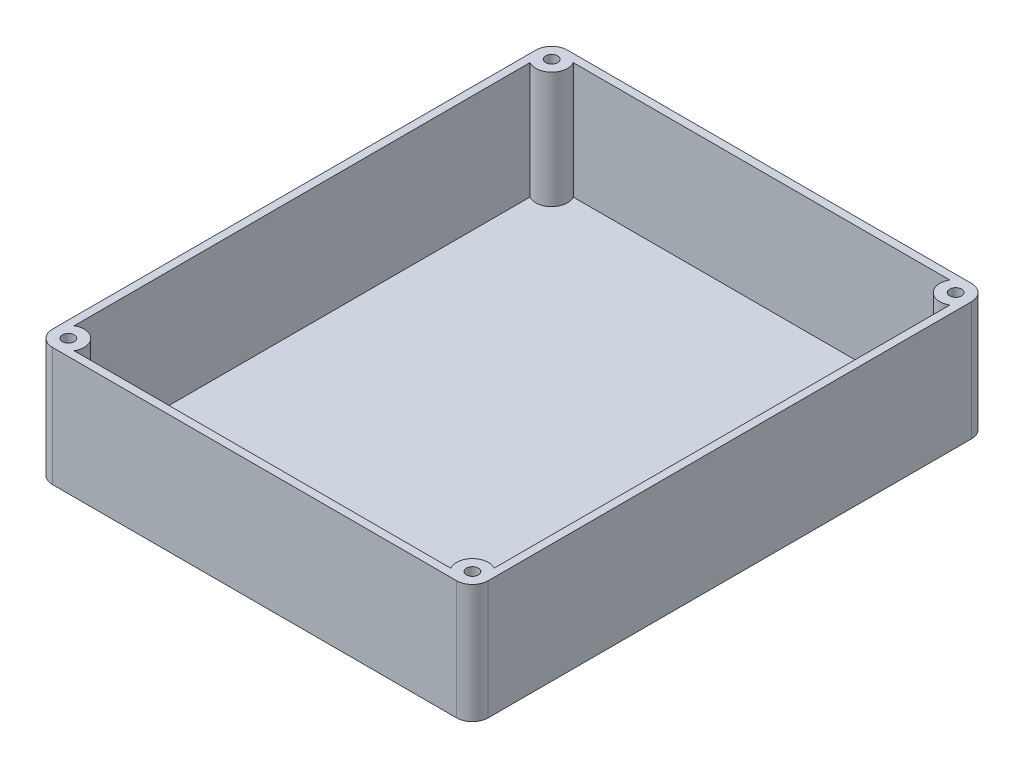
ISO-10303-21;
HEADER;
FILE_DESCRIPTION(('STEP AP214'),'2;1');
FILE_NAME('part.step','',(''),(''),'','','');
FILE_SCHEMA(('AUTOMOTIVE_DESIGN { 1 0 10303 214 1 1 1 1 }'));
ENDSEC;
DATA;
#1=APPLICATION_CONTEXT('core data for automotive mechanical design processes');
#2=APPLICATION_PROTOCOL_DEFINITION('international standard','automotive_design',2000,#1);
#3=PRODUCT_CONTEXT('',#1,'mechanical');
#4=PRODUCT('Part','Part','',(#3));
#5=PRODUCT_RELATED_PRODUCT_CATEGORY('part','',(#4));
#6=PRODUCT_DEFINITION_FORMATION('','',#4);
#7=PRODUCT_DEFINITION_CONTEXT('part definition',#1,'design');
#8=PRODUCT_DEFINITION('design','',#6,#7);
#9=PRODUCT_DEFINITION_SHAPE('','',#8);
#10=(LENGTH_UNIT() NAMED_UNIT(*) SI_UNIT(.MILLI.,.METRE.));
#11=(NAMED_UNIT(*) PLANE_ANGLE_UNIT() SI_UNIT($,.RADIAN.));
#12=(NAMED_UNIT(*) SI_UNIT($,.STERADIAN.) SOLID_ANGLE_UNIT());
#13=UNCERTAINTY_MEASURE_WITH_UNIT(LENGTH_MEASURE(1.E-05),#10,'distance_accuracy_value','');
#14=(GEOMETRIC_REPRESENTATION_CONTEXT(3) GLOBAL_UNCERTAINTY_ASSIGNED_CONTEXT((#13)) GLOBAL_UNIT_ASSIGNED_CONTEXT((#10,
#11,#12)) REPRESENTATION_CONTEXT('',''));
#15=CARTESIAN_POINT('',(0.,0.,0.));
#16=DIRECTION('',(0.,0.,1.));
#17=DIRECTION('',(1.,0.,0.));
#18=AXIS2_PLACEMENT_3D('',#15,#16,#17);
#19=CARTESIAN_POINT('',(53.,30.,-63.));
#20=DIRECTION('',(-1.,0.,0.));
#21=DIRECTION('',(0.,0.,1.));
#22=AXIS2_PLACEMENT_3D('',#19,#20,#21);
#23=PLANE('',#22);
#24=DIRECTION('',(0.,1.,0.));
#25=VECTOR('',#24,1.);
#26=CARTESIAN_POINT('',(53.,-10.7137084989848,57.5358983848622));
#27=LINE('',#26,#25);
#28=CARTESIAN_POINT('',(53.,30.,57.5358983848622));
#29=VERTEX_POINT('',#28);
#30=CARTESIAN_POINT('',(53.,0.6,57.5358983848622));
#31=VERTEX_POINT('',#30);
#32=EDGE_CURVE('E64',#29,#31,#27,.F.);
#33=ORIENTED_EDGE('',*,*,#32,.F.);
#34=DIRECTION('',(0.,0.,-1.));
#35=VECTOR('',#34,1.);
#36=CARTESIAN_POINT('',(53.,30.,-63.));
#37=LINE('',#36,#35);
#38=CARTESIAN_POINT('',(53.,30.,-57.5358983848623));
#39=VERTEX_POINT('',#38);
#40=EDGE_CURVE('E189',#29,#39,#37,.T.);
#41=ORIENTED_EDGE('',*,*,#40,.T.);
#42=DIRECTION('',(0.,1.,0.));
#43=VECTOR('',#42,1.);
#44=CARTESIAN_POINT('',(53.,-10.7137084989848,-57.5358983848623));
#45=LINE('',#44,#43);
#46=CARTESIAN_POINT('',(53.,0.6,-57.5358983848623));
#47=VERTEX_POINT('',#46);
#48=EDGE_CURVE('E401',#47,#39,#45,.T.);
#49=ORIENTED_EDGE('',*,*,#48,.F.);
#50=DIRECTION('',(0.,0.,1.));
#51=VECTOR('',#50,1.);
#52=CARTESIAN_POINT('',(53.,0.6,-63.));
#53=LINE('',#52,#51);
#54=EDGE_CURVE('E180',#47,#31,#53,.T.);
#55=ORIENTED_EDGE('',*,*,#54,.T.);
#56=EDGE_LOOP('',(#33,#41,#49,#55));
#57=FACE_BOUND('',#56,.T.);
#58=ADVANCED_FACE('F41',(#57),#23,.T.);
#59=CARTESIAN_POINT('',(53.,30.,-63.));
#60=DIRECTION('',(0.,0.,1.));
#61=DIRECTION('',(1.,0.,0.));
#62=AXIS2_PLACEMENT_3D('',#59,#60,#61);
#63=PLANE('',#62);
#64=DIRECTION('',(0.,1.,0.));
#65=VECTOR('',#64,1.);
#66=CARTESIAN_POINT('',(47.5358983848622,-10.7137084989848,-63.));
#67=LINE('',#66,#65);
#68=CARTESIAN_POINT('',(47.5358983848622,30.,-63.));
#69=VERTEX_POINT('',#68);
#70=CARTESIAN_POINT('',(47.5358983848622,0.6,-63.));
#71=VERTEX_POINT('',#70);
#72=EDGE_CURVE('E396',#69,#71,#67,.F.);
#73=ORIENTED_EDGE('',*,*,#72,.F.);
#74=DIRECTION('',(-1.,0.,0.));
#75=VECTOR('',#74,1.);
#76=CARTESIAN_POINT('',(53.,30.,-63.));
#77=LINE('',#76,#75);
#78=CARTESIAN_POINT('',(-47.5358983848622,30.,-63.));
#79=VERTEX_POINT('',#78);
#80=EDGE_CURVE('E191',#69,#79,#77,.T.);
#81=ORIENTED_EDGE('',*,*,#80,.T.);
#82=DIRECTION('',(0.,1.,0.));
#83=VECTOR('',#82,1.);
#84=CARTESIAN_POINT('',(-47.5358983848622,-10.7137084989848,-63.));
#85=LINE('',#84,#83);
#86=CARTESIAN_POINT('',(-47.5358983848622,0.6,-63.));
#87=VERTEX_POINT('',#86);
#88=EDGE_CURVE('E177',#87,#79,#85,.T.);
#89=ORIENTED_EDGE('',*,*,#88,.F.);
#90=DIRECTION('',(1.,0.,0.));
#91=VECTOR('',#90,1.);
#92=CARTESIAN_POINT('',(53.,0.6,-63.));
#93=LINE('',#92,#91);
#94=EDGE_CURVE('E176',#87,#71,#93,.T.);
#95=ORIENTED_EDGE('',*,*,#94,.T.);
#96=EDGE_LOOP('',(#73,#81,#89,#95));
#97=FACE_BOUND('',#96,.T.);
#98=ADVANCED_FACE('F287',(#97),#63,.T.);
#99=CARTESIAN_POINT('',(-53.,30.,-63.));
#100=DIRECTION('',(1.,0.,0.));
#101=DIRECTION('',(0.,0.,-1.));
#102=AXIS2_PLACEMENT_3D('',#99,#100,#101);
#103=PLANE('',#102);
#104=DIRECTION('',(0.,1.,0.));
#105=VECTOR('',#104,1.);
#106=CARTESIAN_POINT('',(-53.,-10.7137084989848,57.5358983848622));
#107=LINE('',#106,#105);
#108=CARTESIAN_POINT('',(-53.,0.6,57.5358983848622));
#109=VERTEX_POINT('',#108);
#110=CARTESIAN_POINT('',(-53.,30.,57.5358983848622));
#111=VERTEX_POINT('',#110);
#112=EDGE_CURVE('E154',#109,#111,#107,.T.);
#113=ORIENTED_EDGE('',*,*,#112,.F.);
#114=DIRECTION('',(0.,0.,-1.));
#115=VECTOR('',#114,1.);
#116=CARTESIAN_POINT('',(-53.,0.6,-63.));
#117=LINE('',#116,#115);
#118=CARTESIAN_POINT('',(-53.,0.6,-57.5358983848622));
#119=VERTEX_POINT('',#118);
#120=EDGE_CURVE('E166',#109,#119,#117,.T.);
#121=ORIENTED_EDGE('',*,*,#120,.T.);
#122=DIRECTION('',(0.,1.,0.));
#123=VECTOR('',#122,1.);
#124=CARTESIAN_POINT('',(-53.,-10.7137084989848,-57.5358983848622));
#125=LINE('',#124,#123);
#126=CARTESIAN_POINT('',(-53.,30.,-57.5358983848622));
#127=VERTEX_POINT('',#126);
#128=EDGE_CURVE('E183',#127,#119,#125,.F.);
#129=ORIENTED_EDGE('',*,*,#128,.F.);
#130=DIRECTION('',(0.,0.,1.));
#131=VECTOR('',#130,1.);
#132=CARTESIAN_POINT('',(-53.,30.,-63.));
#133=LINE('',#132,#131);
#134=EDGE_CURVE('E169',#127,#111,#133,.T.);
#135=ORIENTED_EDGE('',*,*,#134,.T.);
#136=EDGE_LOOP('',(#113,#121,#129,#135));
#137=FACE_BOUND('',#136,.T.);
#138=ADVANCED_FACE('F164',(#137),#103,.T.);
#139=CARTESIAN_POINT('',(53.,30.,63.));
#140=DIRECTION('',(0.,0.,-1.));
#141=DIRECTION('',(-1.,0.,0.));
#142=AXIS2_PLACEMENT_3D('',#139,#140,#141);
#143=PLANE('',#142);
#144=DIRECTION('',(0.,1.,0.));
#145=VECTOR('',#144,1.);
#146=CARTESIAN_POINT('',(-47.5358983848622,-10.7137084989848,63.));
#147=LINE('',#146,#145);
#148=CARTESIAN_POINT('',(-47.5358983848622,30.,63.));
#149=VERTEX_POINT('',#148);
#150=CARTESIAN_POINT('',(-47.5358983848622,0.6,63.));
#151=VERTEX_POINT('',#150);
#152=EDGE_CURVE('E56',#149,#151,#147,.F.);
#153=ORIENTED_EDGE('',*,*,#152,.F.);
#154=DIRECTION('',(1.,0.,0.));
#155=VECTOR('',#154,1.);
#156=CARTESIAN_POINT('',(53.,30.,63.));
#157=LINE('',#156,#155);
#158=CARTESIAN_POINT('',(47.5358983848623,30.,63.));
#159=VERTEX_POINT('',#158);
#160=EDGE_CURVE('E194',#149,#159,#157,.T.);
#161=ORIENTED_EDGE('',*,*,#160,.T.);
#162=DIRECTION('',(0.,1.,0.));
#163=VECTOR('',#162,1.);
#164=CARTESIAN_POINT('',(47.5358983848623,-10.7137084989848,63.));
#165=LINE('',#164,#163);
#166=CARTESIAN_POINT('',(47.5358983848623,0.6,63.));
#167=VERTEX_POINT('',#166);
#168=EDGE_CURVE('E387',#167,#159,#165,.T.);
#169=ORIENTED_EDGE('',*,*,#168,.F.);
#170=DIRECTION('',(-1.,0.,0.));
#171=VECTOR('',#170,1.);
#172=CARTESIAN_POINT('',(53.,0.6,63.));
#173=LINE('',#172,#171);
#174=EDGE_CURVE('E210',#167,#151,#173,.T.);
#175=ORIENTED_EDGE('',*,*,#174,.T.);
#176=EDGE_LOOP('',(#153,#161,#169,#175));
#177=FACE_BOUND('',#176,.T.);
#178=ADVANCED_FACE('F301',(#177),#143,.T.);
#179=CARTESIAN_POINT('',(0.,30.,0.));
#180=DIRECTION('',(0.,-1.,0.));
#181=DIRECTION('',(0.,0.,-1.));
#182=AXIS2_PLACEMENT_3D('',#179,#180,#181);
#183=PLANE('',#182);
#184=CARTESIAN_POINT('',(-51.,30.,61.));
#185=DIRECTION('',(0.,-1.,0.));
#186=DIRECTION('',(0.,0.,-1.));
#187=AXIS2_PLACEMENT_3D('',#184,#185,#186);
#188=CIRCLE('',#187,4.);
#189=CARTESIAN_POINT('',(-55.,30.,61.));
#190=VERTEX_POINT('',#189);
#191=CARTESIAN_POINT('',(-51.,30.,65.));
#192=VERTEX_POINT('',#191);
#193=EDGE_CURVE('E238',#190,#192,#188,.F.);
#194=ORIENTED_EDGE('',*,*,#193,.T.);
#195=DIRECTION('',(1.,0.,0.));
#196=VECTOR('',#195,1.);
#197=CARTESIAN_POINT('',(55.,30.,65.));
#198=LINE('',#197,#196);
#199=CARTESIAN_POINT('',(51.,30.,65.));
#200=VERTEX_POINT('',#199);
#201=EDGE_CURVE('E200',#192,#200,#198,.T.);
#202=ORIENTED_EDGE('',*,*,#201,.T.);
#203=CARTESIAN_POINT('',(51.,30.,61.));
#204=DIRECTION('',(0.,-1.,0.));
#205=DIRECTION('',(0.,0.,-1.));
#206=AXIS2_PLACEMENT_3D('',#203,#204,#205);
#207=CIRCLE('',#206,4.);
#208=CARTESIAN_POINT('',(55.,30.,61.));
#209=VERTEX_POINT('',#208);
#210=EDGE_CURVE('E244',#200,#209,#207,.F.);
#211=ORIENTED_EDGE('',*,*,#210,.T.);
#212=DIRECTION('',(0.,0.,-1.));
#213=VECTOR('',#212,1.);
#214=CARTESIAN_POINT('',(55.,30.,-65.));
#215=LINE('',#214,#213);
#216=CARTESIAN_POINT('',(55.,30.,-61.));
#217=VERTEX_POINT('',#216);
#218=EDGE_CURVE('E204',#209,#217,#215,.T.);
#219=ORIENTED_EDGE('',*,*,#218,.T.);
#220=CARTESIAN_POINT('',(51.,30.,-61.));
#221=DIRECTION('',(0.,-1.,0.));
#222=DIRECTION('',(0.,0.,-1.));
#223=AXIS2_PLACEMENT_3D('',#220,#221,#222);
#224=CIRCLE('',#223,4.);
#225=CARTESIAN_POINT('',(51.,30.,-65.));
#226=VERTEX_POINT('',#225);
#227=EDGE_CURVE('E242',#217,#226,#224,.F.);
#228=ORIENTED_EDGE('',*,*,#227,.T.);
#229=DIRECTION('',(-1.,0.,0.));
#230=VECTOR('',#229,1.);
#231=CARTESIAN_POINT('',(55.,30.,-65.));
#232=LINE('',#231,#230);
#233=CARTESIAN_POINT('',(-51.,30.,-65.));
#234=VERTEX_POINT('',#233);
#235=EDGE_CURVE('E207',#226,#234,#232,.T.);
#236=ORIENTED_EDGE('',*,*,#235,.T.);
#237=CARTESIAN_POINT('',(-51.,30.,-61.));
#238=DIRECTION('',(0.,-1.,0.));
#239=DIRECTION('',(0.,0.,-1.));
#240=AXIS2_PLACEMENT_3D('',#237,#238,#239);
#241=CIRCLE('',#240,4.);
#242=CARTESIAN_POINT('',(-55.,30.,-61.));
#243=VERTEX_POINT('',#242);
#244=EDGE_CURVE('E240',#234,#243,#241,.F.);
#245=ORIENTED_EDGE('',*,*,#244,.T.);
#246=DIRECTION('',(0.,0.,1.));
#247=VECTOR('',#246,1.);
#248=CARTESIAN_POINT('',(-55.,30.,-65.));
#249=LINE('',#248,#247);
#250=EDGE_CURVE('E197',#243,#190,#249,.T.);
#251=ORIENTED_EDGE('',*,*,#250,.T.);
#252=EDGE_LOOP('',(#194,#202,#211,#219,#228,#236,#245,#251));
#253=FACE_BOUND('',#252,.T.);
#254=ORIENTED_EDGE('',*,*,#160,.F.);
#255=CARTESIAN_POINT('',(-51.,30.,61.));
#256=DIRECTION('',(0.,1.,0.));
#257=DIRECTION('',(0.,0.,1.));
#258=AXIS2_PLACEMENT_3D('',#255,#256,#257);
#259=CIRCLE('',#258,4.00000000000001);
#260=EDGE_CURVE('E380',#149,#111,#259,.T.);
#261=ORIENTED_EDGE('',*,*,#260,.T.);
#262=ORIENTED_EDGE('',*,*,#134,.F.);
#263=CARTESIAN_POINT('',(-51.,30.,-61.));
#264=DIRECTION('',(0.,1.,0.));
#265=DIRECTION('',(0.,0.,1.));
#266=AXIS2_PLACEMENT_3D('',#263,#264,#265);
#267=CIRCLE('',#266,4.00000000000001);
#268=EDGE_CURVE('E404',#127,#79,#267,.T.);
#269=ORIENTED_EDGE('',*,*,#268,.T.);
#270=ORIENTED_EDGE('',*,*,#80,.F.);
#271=CARTESIAN_POINT('',(51.,30.,-61.));
#272=DIRECTION('',(0.,1.,0.));
#273=DIRECTION('',(0.,0.,1.));
#274=AXIS2_PLACEMENT_3D('',#271,#272,#273);
#275=CIRCLE('',#274,4.00000000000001);
#276=EDGE_CURVE('E393',#69,#39,#275,.T.);
#277=ORIENTED_EDGE('',*,*,#276,.T.);
#278=ORIENTED_EDGE('',*,*,#40,.F.);
#279=CARTESIAN_POINT('',(51.,30.,61.));
#280=DIRECTION('',(0.,1.,0.));
#281=DIRECTION('',(0.,0.,1.));
#282=AXIS2_PLACEMENT_3D('',#279,#280,#281);
#283=CIRCLE('',#282,4.00000000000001);
#284=EDGE_CURVE('E170',#29,#159,#283,.T.);
#285=ORIENTED_EDGE('',*,*,#284,.T.);
#286=EDGE_LOOP('',(#254,#261,#262,#269,#270,#277,#278,#285));
#287=FACE_BOUND('',#286,.T.);
#288=CARTESIAN_POINT('',(-51.,30.,-61.));
#289=DIRECTION('',(0.,1.,0.));
#290=DIRECTION('',(0.,0.,1.));
#291=AXIS2_PLACEMENT_3D('',#288,#289,#290);
#292=CIRCLE('',#291,1.5);
#293=CARTESIAN_POINT('',(-51.,30.,-59.5));
#294=VERTEX_POINT('',#293);
#295=EDGE_CURVE('E368',#294,#294,#292,.T.);
#296=ORIENTED_EDGE('',*,*,#295,.F.);
#297=EDGE_LOOP('',(#296));
#298=FACE_BOUND('',#297,.T.);
#299=CARTESIAN_POINT('',(51.,30.,-61.));
#300=DIRECTION('',(0.,1.,0.));
#301=DIRECTION('',(0.,0.,1.));
#302=AXIS2_PLACEMENT_3D('',#299,#300,#301);
#303=CIRCLE('',#302,1.5);
#304=CARTESIAN_POINT('',(51.,30.,-59.5));
#305=VERTEX_POINT('',#304);
#306=EDGE_CURVE('E372',#305,#305,#303,.T.);
#307=ORIENTED_EDGE('',*,*,#306,.F.);
#308=EDGE_LOOP('',(#307));
#309=FACE_BOUND('',#308,.T.);
#310=CARTESIAN_POINT('',(51.,30.,61.));
#311=DIRECTION('',(0.,1.,0.));
#312=DIRECTION('',(0.,0.,1.));
#313=AXIS2_PLACEMENT_3D('',#310,#311,#312);
#314=CIRCLE('',#313,1.5);
#315=CARTESIAN_POINT('',(51.,30.,62.5));
#316=VERTEX_POINT('',#315);
#317=EDGE_CURVE('E376',#316,#316,#314,.T.);
#318=ORIENTED_EDGE('',*,*,#317,.F.);
#319=EDGE_LOOP('',(#318));
#320=FACE_BOUND('',#319,.T.);
#321=CARTESIAN_POINT('',(-51.,30.,61.));
#322=DIRECTION('',(0.,1.,0.));
#323=DIRECTION('',(0.,0.,1.));
#324=AXIS2_PLACEMENT_3D('',#321,#322,#323);
#325=CIRCLE('',#324,1.5);
#326=CARTESIAN_POINT('',(-51.,30.,62.5));
#327=VERTEX_POINT('',#326);
#328=EDGE_CURVE('E160',#327,#327,#325,.T.);
#329=ORIENTED_EDGE('',*,*,#328,.F.);
#330=EDGE_LOOP('',(#329));
#331=FACE_BOUND('',#330,.T.);
#332=ADVANCED_FACE('F297',(#253,#287,#298,#309,#320,#331),#183,.F.);
#333=CARTESIAN_POINT('',(0.,0.,0.));
#334=DIRECTION('',(0.,-1.,0.));
#335=DIRECTION('',(0.,0.,-1.));
#336=AXIS2_PLACEMENT_3D('',#333,#334,#335);
#337=PLANE('',#336);
#338=DIRECTION('',(0.,0.,-1.));
#339=VECTOR('',#338,1.);
#340=CARTESIAN_POINT('',(55.,0.,-65.));
#341=LINE('',#340,#339);
#342=CARTESIAN_POINT('',(55.,0.,61.));
#343=VERTEX_POINT('',#342);
#344=CARTESIAN_POINT('',(55.,0.,-61.));
#345=VERTEX_POINT('',#344);
#346=EDGE_CURVE('E216',#343,#345,#341,.T.);
#347=ORIENTED_EDGE('',*,*,#346,.F.);
#348=CARTESIAN_POINT('',(51.,0.,61.));
#349=DIRECTION('',(0.,-1.,0.));
#350=DIRECTION('',(0.,0.,-1.));
#351=AXIS2_PLACEMENT_3D('',#348,#349,#350);
#352=CIRCLE('',#351,4.);
#353=CARTESIAN_POINT('',(51.,0.,65.));
#354=VERTEX_POINT('',#353);
#355=EDGE_CURVE('E232',#343,#354,#352,.T.);
#356=ORIENTED_EDGE('',*,*,#355,.T.);
#357=DIRECTION('',(1.,0.,0.));
#358=VECTOR('',#357,1.);
#359=CARTESIAN_POINT('',(55.,0.,65.));
#360=LINE('',#359,#358);
#361=CARTESIAN_POINT('',(-51.,0.,65.));
#362=VERTEX_POINT('',#361);
#363=EDGE_CURVE('E213',#362,#354,#360,.T.);
#364=ORIENTED_EDGE('',*,*,#363,.F.);
#365=CARTESIAN_POINT('',(-51.,0.,61.));
#366=DIRECTION('',(0.,-1.,0.));
#367=DIRECTION('',(0.,0.,-1.));
#368=AXIS2_PLACEMENT_3D('',#365,#366,#367);
#369=CIRCLE('',#368,4.);
#370=CARTESIAN_POINT('',(-55.,0.,61.));
#371=VERTEX_POINT('',#370);
#372=EDGE_CURVE('E226',#362,#371,#369,.T.);
#373=ORIENTED_EDGE('',*,*,#372,.T.);
#374=DIRECTION('',(0.,0.,1.));
#375=VECTOR('',#374,1.);
#376=CARTESIAN_POINT('',(-55.,0.,-65.));
#377=LINE('',#376,#375);
#378=CARTESIAN_POINT('',(-55.,0.,-61.));
#379=VERTEX_POINT('',#378);
#380=EDGE_CURVE('E196',#379,#371,#377,.T.);
#381=ORIENTED_EDGE('',*,*,#380,.F.);
#382=CARTESIAN_POINT('',(-51.,0.,-61.));
#383=DIRECTION('',(0.,-1.,0.));
#384=DIRECTION('',(0.,0.,-1.));
#385=AXIS2_PLACEMENT_3D('',#382,#383,#384);
#386=CIRCLE('',#385,4.);
#387=CARTESIAN_POINT('',(-51.,0.,-65.));
#388=VERTEX_POINT('',#387);
#389=EDGE_CURVE('E228',#379,#388,#386,.T.);
#390=ORIENTED_EDGE('',*,*,#389,.T.);
#391=DIRECTION('',(-1.,0.,0.));
#392=VECTOR('',#391,1.);
#393=CARTESIAN_POINT('',(55.,0.,-65.));
#394=LINE('',#393,#392);
#395=CARTESIAN_POINT('',(51.,0.,-65.));
#396=VERTEX_POINT('',#395);
#397=EDGE_CURVE('E201',#396,#388,#394,.T.);
#398=ORIENTED_EDGE('',*,*,#397,.F.);
#399=CARTESIAN_POINT('',(51.,0.,-61.));
#400=DIRECTION('',(0.,-1.,0.));
#401=DIRECTION('',(0.,0.,-1.));
#402=AXIS2_PLACEMENT_3D('',#399,#400,#401);
#403=CIRCLE('',#402,4.);
#404=EDGE_CURVE('E230',#396,#345,#403,.T.);
#405=ORIENTED_EDGE('',*,*,#404,.T.);
#406=EDGE_LOOP('',(#347,#356,#364,#373,#381,#390,#398,#405));
#407=FACE_BOUND('',#406,.T.);
#408=ADVANCED_FACE('F300',(#407),#337,.T.);
#409=CARTESIAN_POINT('',(-55.,30.,-65.));
#410=DIRECTION('',(1.,0.,0.));
#411=DIRECTION('',(0.,0.,-1.));
#412=AXIS2_PLACEMENT_3D('',#409,#410,#411);
#413=PLANE('',#412);
#414=ORIENTED_EDGE('',*,*,#250,.F.);
#415=DIRECTION('',(0.,-1.,0.));
#416=VECTOR('',#415,1.);
#417=CARTESIAN_POINT('',(-55.,30.,-61.));
#418=LINE('',#417,#416);
#419=EDGE_CURVE('E252',#243,#379,#418,.T.);
#420=ORIENTED_EDGE('',*,*,#419,.T.);
#421=ORIENTED_EDGE('',*,*,#380,.T.);
#422=DIRECTION('',(0.,-1.,0.));
#423=VECTOR('',#422,1.);
#424=CARTESIAN_POINT('',(-55.,30.,61.));
#425=LINE('',#424,#423);
#426=EDGE_CURVE('E250',#371,#190,#425,.F.);
#427=ORIENTED_EDGE('',*,*,#426,.T.);
#428=EDGE_LOOP('',(#414,#420,#421,#427));
#429=FACE_BOUND('',#428,.T.);
#430=ADVANCED_FACE('F305',(#429),#413,.F.);
#431=CARTESIAN_POINT('',(55.,30.,65.));
#432=DIRECTION('',(0.,0.,-1.));
#433=DIRECTION('',(-1.,0.,0.));
#434=AXIS2_PLACEMENT_3D('',#431,#432,#433);
#435=PLANE('',#434);
#436=ORIENTED_EDGE('',*,*,#363,.T.);
#437=DIRECTION('',(0.,-1.,0.));
#438=VECTOR('',#437,1.);
#439=CARTESIAN_POINT('',(51.,30.,65.));
#440=LINE('',#439,#438);
#441=EDGE_CURVE('E236',#354,#200,#440,.F.);
#442=ORIENTED_EDGE('',*,*,#441,.T.);
#443=ORIENTED_EDGE('',*,*,#201,.F.);
#444=DIRECTION('',(0.,-1.,0.));
#445=VECTOR('',#444,1.);
#446=CARTESIAN_POINT('',(-51.,30.,65.));
#447=LINE('',#446,#445);
#448=EDGE_CURVE('E234',#192,#362,#447,.T.);
#449=ORIENTED_EDGE('',*,*,#448,.T.);
#450=EDGE_LOOP('',(#436,#442,#443,#449));
#451=FACE_BOUND('',#450,.T.);
#452=ADVANCED_FACE('F314',(#451),#435,.F.);
#453=CARTESIAN_POINT('',(55.,30.,-65.));
#454=DIRECTION('',(-1.,0.,0.));
#455=DIRECTION('',(0.,0.,1.));
#456=AXIS2_PLACEMENT_3D('',#453,#454,#455);
#457=PLANE('',#456);
#458=ORIENTED_EDGE('',*,*,#218,.F.);
#459=DIRECTION('',(0.,-1.,0.));
#460=VECTOR('',#459,1.);
#461=CARTESIAN_POINT('',(55.,30.,61.));
#462=LINE('',#461,#460);
#463=EDGE_CURVE('E224',#209,#343,#462,.T.);
#464=ORIENTED_EDGE('',*,*,#463,.T.);
#465=ORIENTED_EDGE('',*,*,#346,.T.);
#466=DIRECTION('',(0.,-1.,0.));
#467=VECTOR('',#466,1.);
#468=CARTESIAN_POINT('',(55.,30.,-61.));
#469=LINE('',#468,#467);
#470=EDGE_CURVE('E222',#345,#217,#469,.F.);
#471=ORIENTED_EDGE('',*,*,#470,.T.);
#472=EDGE_LOOP('',(#458,#464,#465,#471));
#473=FACE_BOUND('',#472,.T.);
#474=ADVANCED_FACE('F310',(#473),#457,.F.);
#475=CARTESIAN_POINT('',(55.,30.,-65.));
#476=DIRECTION('',(0.,0.,1.));
#477=DIRECTION('',(1.,0.,0.));
#478=AXIS2_PLACEMENT_3D('',#475,#476,#477);
#479=PLANE('',#478);
#480=ORIENTED_EDGE('',*,*,#235,.F.);
#481=DIRECTION('',(0.,-1.,0.));
#482=VECTOR('',#481,1.);
#483=CARTESIAN_POINT('',(51.,30.,-65.));
#484=LINE('',#483,#482);
#485=EDGE_CURVE('E248',#226,#396,#484,.T.);
#486=ORIENTED_EDGE('',*,*,#485,.T.);
#487=ORIENTED_EDGE('',*,*,#397,.T.);
#488=DIRECTION('',(0.,-1.,0.));
#489=VECTOR('',#488,1.);
#490=CARTESIAN_POINT('',(-51.,30.,-65.));
#491=LINE('',#490,#489);
#492=EDGE_CURVE('E246',#388,#234,#491,.F.);
#493=ORIENTED_EDGE('',*,*,#492,.T.);
#494=EDGE_LOOP('',(#480,#486,#487,#493));
#495=FACE_BOUND('',#494,.T.);
#496=ADVANCED_FACE('F307',(#495),#479,.F.);
#497=CARTESIAN_POINT('',(0.,0.6,0.));
#498=DIRECTION('',(0.,-1.,0.));
#499=DIRECTION('',(0.,0.,-1.));
#500=AXIS2_PLACEMENT_3D('',#497,#498,#499);
#501=PLANE('',#500);
#502=ORIENTED_EDGE('',*,*,#120,.F.);
#503=CARTESIAN_POINT('',(-51.,0.6,61.));
#504=DIRECTION('',(0.,-1.,0.));
#505=DIRECTION('',(0.,0.,-1.));
#506=AXIS2_PLACEMENT_3D('',#503,#504,#505);
#507=CIRCLE('',#506,4.00000000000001);
#508=EDGE_CURVE('E151',#151,#109,#507,.F.);
#509=ORIENTED_EDGE('',*,*,#508,.F.);
#510=ORIENTED_EDGE('',*,*,#174,.F.);
#511=CARTESIAN_POINT('',(51.,0.6,61.));
#512=DIRECTION('',(0.,-1.,0.));
#513=DIRECTION('',(0.,0.,-1.));
#514=AXIS2_PLACEMENT_3D('',#511,#512,#513);
#515=CIRCLE('',#514,4.00000000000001);
#516=EDGE_CURVE('E385',#31,#167,#515,.F.);
#517=ORIENTED_EDGE('',*,*,#516,.F.);
#518=ORIENTED_EDGE('',*,*,#54,.F.);
#519=CARTESIAN_POINT('',(51.,0.6,-61.));
#520=DIRECTION('',(0.,-1.,0.));
#521=DIRECTION('',(0.,0.,-1.));
#522=AXIS2_PLACEMENT_3D('',#519,#520,#521);
#523=CIRCLE('',#522,4.00000000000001);
#524=EDGE_CURVE('E394',#71,#47,#523,.F.);
#525=ORIENTED_EDGE('',*,*,#524,.F.);
#526=ORIENTED_EDGE('',*,*,#94,.F.);
#527=CARTESIAN_POINT('',(-51.,0.6,-61.));
#528=DIRECTION('',(0.,-1.,0.));
#529=DIRECTION('',(0.,0.,-1.));
#530=AXIS2_PLACEMENT_3D('',#527,#528,#529);
#531=CIRCLE('',#530,4.00000000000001);
#532=EDGE_CURVE('E175',#119,#87,#531,.F.);
#533=ORIENTED_EDGE('',*,*,#532,.F.);
#534=EDGE_LOOP('',(#502,#509,#510,#517,#518,#525,#526,#533));
#535=FACE_BOUND('',#534,.T.);
#536=ADVANCED_FACE('F173',(#535),#501,.F.);
#537=CARTESIAN_POINT('',(51.,30.,61.));
#538=DIRECTION('',(0.,-1.,0.));
#539=DIRECTION('',(0.,0.,-1.));
#540=AXIS2_PLACEMENT_3D('',#537,#538,#539);
#541=CYLINDRICAL_SURFACE('',#540,4.);
#542=ORIENTED_EDGE('',*,*,#355,.F.);
#543=ORIENTED_EDGE('',*,*,#463,.F.);
#544=ORIENTED_EDGE('',*,*,#210,.F.);
#545=ORIENTED_EDGE('',*,*,#441,.F.);
#546=EDGE_LOOP('',(#542,#543,#544,#545));
#547=FACE_BOUND('',#546,.T.);
#548=ADVANCED_FACE('F322',(#547),#541,.T.);
#549=CARTESIAN_POINT('',(51.,30.,-61.));
#550=DIRECTION('',(0.,-1.,0.));
#551=DIRECTION('',(0.,0.,-1.));
#552=AXIS2_PLACEMENT_3D('',#549,#550,#551);
#553=CYLINDRICAL_SURFACE('',#552,4.);
#554=ORIENTED_EDGE('',*,*,#404,.F.);
#555=ORIENTED_EDGE('',*,*,#485,.F.);
#556=ORIENTED_EDGE('',*,*,#227,.F.);
#557=ORIENTED_EDGE('',*,*,#470,.F.);
#558=EDGE_LOOP('',(#554,#555,#556,#557));
#559=FACE_BOUND('',#558,.T.);
#560=ADVANCED_FACE('F325',(#559),#553,.T.);
#561=CARTESIAN_POINT('',(-51.,30.,-61.));
#562=DIRECTION('',(0.,-1.,0.));
#563=DIRECTION('',(0.,0.,-1.));
#564=AXIS2_PLACEMENT_3D('',#561,#562,#563);
#565=CYLINDRICAL_SURFACE('',#564,4.);
#566=ORIENTED_EDGE('',*,*,#389,.F.);
#567=ORIENTED_EDGE('',*,*,#419,.F.);
#568=ORIENTED_EDGE('',*,*,#244,.F.);
#569=ORIENTED_EDGE('',*,*,#492,.F.);
#570=EDGE_LOOP('',(#566,#567,#568,#569));
#571=FACE_BOUND('',#570,.T.);
#572=ADVANCED_FACE('F328',(#571),#565,.T.);
#573=CARTESIAN_POINT('',(-51.,30.,61.));
#574=DIRECTION('',(0.,-1.,0.));
#575=DIRECTION('',(0.,0.,-1.));
#576=AXIS2_PLACEMENT_3D('',#573,#574,#575);
#577=CYLINDRICAL_SURFACE('',#576,4.);
#578=ORIENTED_EDGE('',*,*,#372,.F.);
#579=ORIENTED_EDGE('',*,*,#448,.F.);
#580=ORIENTED_EDGE('',*,*,#193,.F.);
#581=ORIENTED_EDGE('',*,*,#426,.F.);
#582=EDGE_LOOP('',(#578,#579,#580,#581));
#583=FACE_BOUND('',#582,.T.);
#584=ADVANCED_FACE('F43',(#583),#577,.T.);
#585=CARTESIAN_POINT('',(-51.,-10.7137084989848,-61.));
#586=DIRECTION('',(0.,1.,0.));
#587=DIRECTION('',(0.,0.,1.));
#588=AXIS2_PLACEMENT_3D('',#585,#586,#587);
#589=CYLINDRICAL_SURFACE('',#588,4.00000000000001);
#590=ORIENTED_EDGE('',*,*,#532,.T.);
#591=ORIENTED_EDGE('',*,*,#88,.T.);
#592=ORIENTED_EDGE('',*,*,#268,.F.);
#593=ORIENTED_EDGE('',*,*,#128,.T.);
#594=EDGE_LOOP('',(#590,#591,#592,#593));
#595=FACE_BOUND('',#594,.T.);
#596=ADVANCED_FACE('F335',(#595),#589,.T.);
#597=CARTESIAN_POINT('',(-51.,-10.7137084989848,-61.));
#598=DIRECTION('',(0.,1.,0.));
#599=DIRECTION('',(0.,0.,1.));
#600=AXIS2_PLACEMENT_3D('',#597,#598,#599);
#601=CYLINDRICAL_SURFACE('',#600,1.5);
#602=ORIENTED_EDGE('',*,*,#295,.T.);
#603=EDGE_LOOP('',(#602));
#604=FACE_BOUND('',#603,.T.);
#605=CARTESIAN_POINT('',(-51.,0.6,-61.));
#606=DIRECTION('',(0.,-1.,0.));
#607=DIRECTION('',(0.,0.,-1.));
#608=AXIS2_PLACEMENT_3D('',#605,#606,#607);
#609=CIRCLE('',#608,1.5);
#610=CARTESIAN_POINT('',(-51.,0.6,-62.5));
#611=VERTEX_POINT('',#610);
#612=EDGE_CURVE('E254',#611,#611,#609,.T.);
#613=ORIENTED_EDGE('',*,*,#612,.T.);
#614=EDGE_LOOP('',(#613));
#615=FACE_BOUND('',#614,.T.);
#616=ADVANCED_FACE('F431',(#604,#615),#601,.F.);
#617=ORIENTED_EDGE('',*,*,#612,.F.);
#618=EDGE_LOOP('',(#617));
#619=FACE_BOUND('',#618,.T.);
#620=ADVANCED_FACE('F283',(#619),#501,.F.);
#621=CARTESIAN_POINT('',(51.,-10.7137084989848,-61.));
#622=DIRECTION('',(0.,1.,0.));
#623=DIRECTION('',(0.,0.,1.));
#624=AXIS2_PLACEMENT_3D('',#621,#622,#623);
#625=CYLINDRICAL_SURFACE('',#624,4.00000000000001);
#626=ORIENTED_EDGE('',*,*,#524,.T.);
#627=ORIENTED_EDGE('',*,*,#48,.T.);
#628=ORIENTED_EDGE('',*,*,#276,.F.);
#629=ORIENTED_EDGE('',*,*,#72,.T.);
#630=EDGE_LOOP('',(#626,#627,#628,#629));
#631=FACE_BOUND('',#630,.T.);
#632=ADVANCED_FACE('F418',(#631),#625,.T.);
#633=CARTESIAN_POINT('',(51.,-10.7137084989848,-61.));
#634=DIRECTION('',(0.,1.,0.));
#635=DIRECTION('',(0.,0.,1.));
#636=AXIS2_PLACEMENT_3D('',#633,#634,#635);
#637=CYLINDRICAL_SURFACE('',#636,1.5);
#638=ORIENTED_EDGE('',*,*,#306,.T.);
#639=EDGE_LOOP('',(#638));
#640=FACE_BOUND('',#639,.T.);
#641=CARTESIAN_POINT('',(51.,0.6,-61.));
#642=DIRECTION('',(0.,-1.,0.));
#643=DIRECTION('',(0.,0.,-1.));
#644=AXIS2_PLACEMENT_3D('',#641,#642,#643);
#645=CIRCLE('',#644,1.5);
#646=CARTESIAN_POINT('',(51.,0.6,-62.5));
#647=VERTEX_POINT('',#646);
#648=EDGE_CURVE('E257',#647,#647,#645,.T.);
#649=ORIENTED_EDGE('',*,*,#648,.T.);
#650=EDGE_LOOP('',(#649));
#651=FACE_BOUND('',#650,.T.);
#652=ADVANCED_FACE('F281',(#640,#651),#637,.F.);
#653=ORIENTED_EDGE('',*,*,#648,.F.);
#654=EDGE_LOOP('',(#653));
#655=FACE_BOUND('',#654,.T.);
#656=ADVANCED_FACE('F267',(#655),#501,.F.);
#657=CARTESIAN_POINT('',(51.,-10.7137084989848,61.));
#658=DIRECTION('',(0.,1.,0.));
#659=DIRECTION('',(0.,0.,1.));
#660=AXIS2_PLACEMENT_3D('',#657,#658,#659);
#661=CYLINDRICAL_SURFACE('',#660,4.00000000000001);
#662=ORIENTED_EDGE('',*,*,#284,.F.);
#663=ORIENTED_EDGE('',*,*,#32,.T.);
#664=ORIENTED_EDGE('',*,*,#516,.T.);
#665=ORIENTED_EDGE('',*,*,#168,.T.);
#666=EDGE_LOOP('',(#662,#663,#664,#665));
#667=FACE_BOUND('',#666,.T.);
#668=ADVANCED_FACE('F275',(#667),#661,.T.);
#669=CARTESIAN_POINT('',(51.,-10.7137084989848,61.));
#670=DIRECTION('',(0.,1.,0.));
#671=DIRECTION('',(0.,0.,1.));
#672=AXIS2_PLACEMENT_3D('',#669,#670,#671);
#673=CYLINDRICAL_SURFACE('',#672,1.5);
#674=ORIENTED_EDGE('',*,*,#317,.T.);
#675=EDGE_LOOP('',(#674));
#676=FACE_BOUND('',#675,.T.);
#677=CARTESIAN_POINT('',(51.,0.6,61.));
#678=DIRECTION('',(0.,-1.,0.));
#679=DIRECTION('',(0.,0.,-1.));
#680=AXIS2_PLACEMENT_3D('',#677,#678,#679);
#681=CIRCLE('',#680,1.5);
#682=CARTESIAN_POINT('',(51.,0.6,59.5));
#683=VERTEX_POINT('',#682);
#684=EDGE_CURVE('E49',#683,#683,#681,.T.);
#685=ORIENTED_EDGE('',*,*,#684,.T.);
#686=EDGE_LOOP('',(#685));
#687=FACE_BOUND('',#686,.T.);
#688=ADVANCED_FACE('F262',(#676,#687),#673,.F.);
#689=ORIENTED_EDGE('',*,*,#684,.F.);
#690=EDGE_LOOP('',(#689));
#691=FACE_BOUND('',#690,.T.);
#692=ADVANCED_FACE('F264',(#691),#501,.F.);
#693=CARTESIAN_POINT('',(-51.,-10.7137084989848,61.));
#694=DIRECTION('',(0.,1.,0.));
#695=DIRECTION('',(0.,0.,1.));
#696=AXIS2_PLACEMENT_3D('',#693,#694,#695);
#697=CYLINDRICAL_SURFACE('',#696,4.00000000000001);
#698=ORIENTED_EDGE('',*,*,#508,.T.);
#699=ORIENTED_EDGE('',*,*,#112,.T.);
#700=ORIENTED_EDGE('',*,*,#260,.F.);
#701=ORIENTED_EDGE('',*,*,#152,.T.);
#702=EDGE_LOOP('',(#698,#699,#700,#701));
#703=FACE_BOUND('',#702,.T.);
#704=ADVANCED_FACE('F153',(#703),#697,.T.);
#705=CARTESIAN_POINT('',(-51.,-10.7137084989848,61.));
#706=DIRECTION('',(0.,1.,0.));
#707=DIRECTION('',(0.,0.,1.));
#708=AXIS2_PLACEMENT_3D('',#705,#706,#707);
#709=CYLINDRICAL_SURFACE('',#708,1.5);
#710=ORIENTED_EDGE('',*,*,#328,.T.);
#711=EDGE_LOOP('',(#710));
#712=FACE_BOUND('',#711,.T.);
#713=CARTESIAN_POINT('',(-51.,0.6,61.));
#714=DIRECTION('',(0.,-1.,0.));
#715=DIRECTION('',(0.,0.,-1.));
#716=AXIS2_PLACEMENT_3D('',#713,#714,#715);
#717=CIRCLE('',#716,1.5);
#718=CARTESIAN_POINT('',(-51.,0.6,59.5));
#719=VERTEX_POINT('',#718);
#720=EDGE_CURVE('E11',#719,#719,#717,.T.);
#721=ORIENTED_EDGE('',*,*,#720,.T.);
#722=EDGE_LOOP('',(#721));
#723=FACE_BOUND('',#722,.T.);
#724=ADVANCED_FACE('F273',(#712,#723),#709,.F.);
#725=ORIENTED_EDGE('',*,*,#720,.F.);
#726=EDGE_LOOP('',(#725));
#727=FACE_BOUND('',#726,.T.);
#728=ADVANCED_FACE('F268',(#727),#501,.F.);
#729=CLOSED_SHELL('',(#58,#98,#138,#178,#332,#408,#430,#452,#474,#496,#536,#548,#560,#572,#584,
#596,#616,#620,#632,#652,#656,#668,#688,#692,#704,#724,#728));
#730=MANIFOLD_SOLID_BREP('B2',#729);
#731=ADVANCED_BREP_SHAPE_REPRESENTATION('',(#18,#730),#14);
#732=SHAPE_DEFINITION_REPRESENTATION(#9,#731);
ENDSEC;
END-ISO-10303-21;
